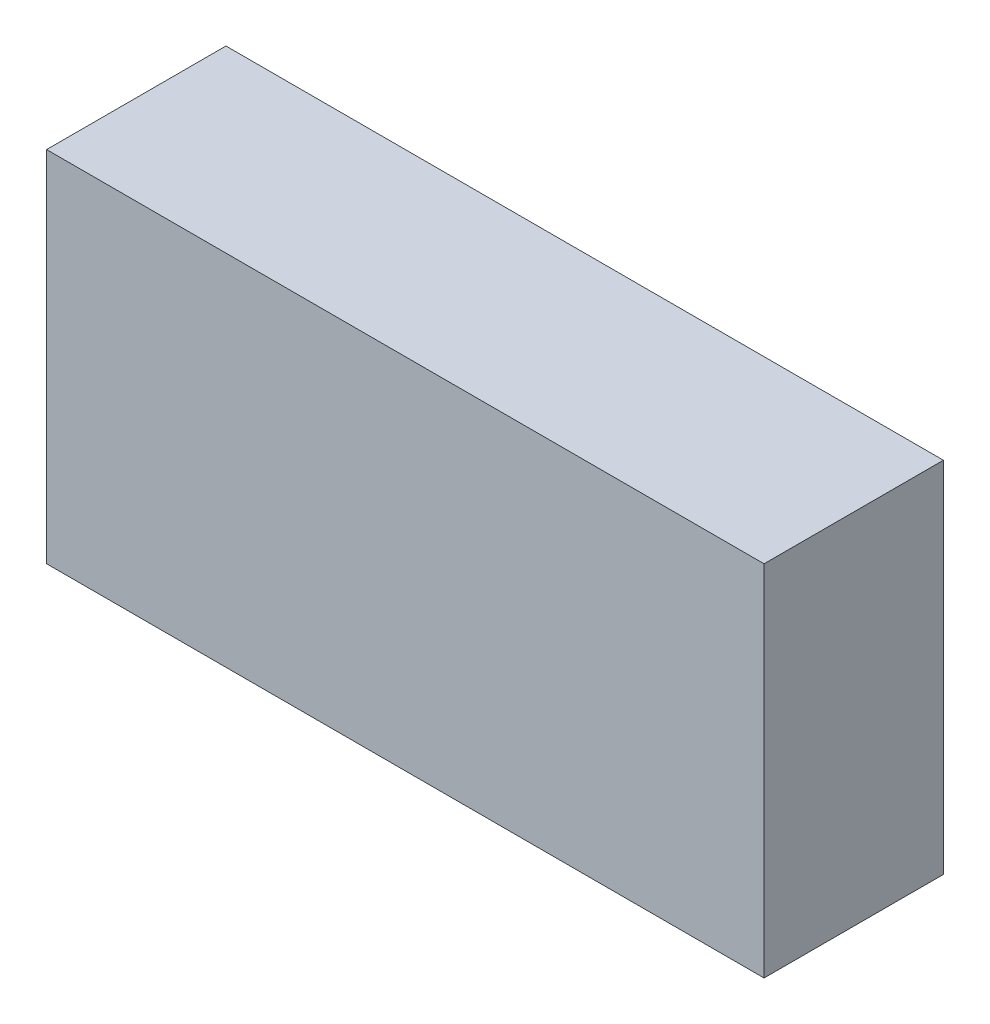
from build123d import *

# Parameters (mm, degrees)
SKIZZE1_W                    = 200
SKIZZE1_H                    = 100
BASIS_LINEAR_AUSTRAGEN_DEPTH = 50


with BuildPart() as part:
    # Skizze1 → Basis-Linear austragen (new body)
    with BuildSketch(Plane.XY):
        Rectangle(SKIZZE1_W, SKIZZE1_H)
    extrude(amount=BASIS_LINEAR_AUSTRAGEN_DEPTH)


solid = part.part
